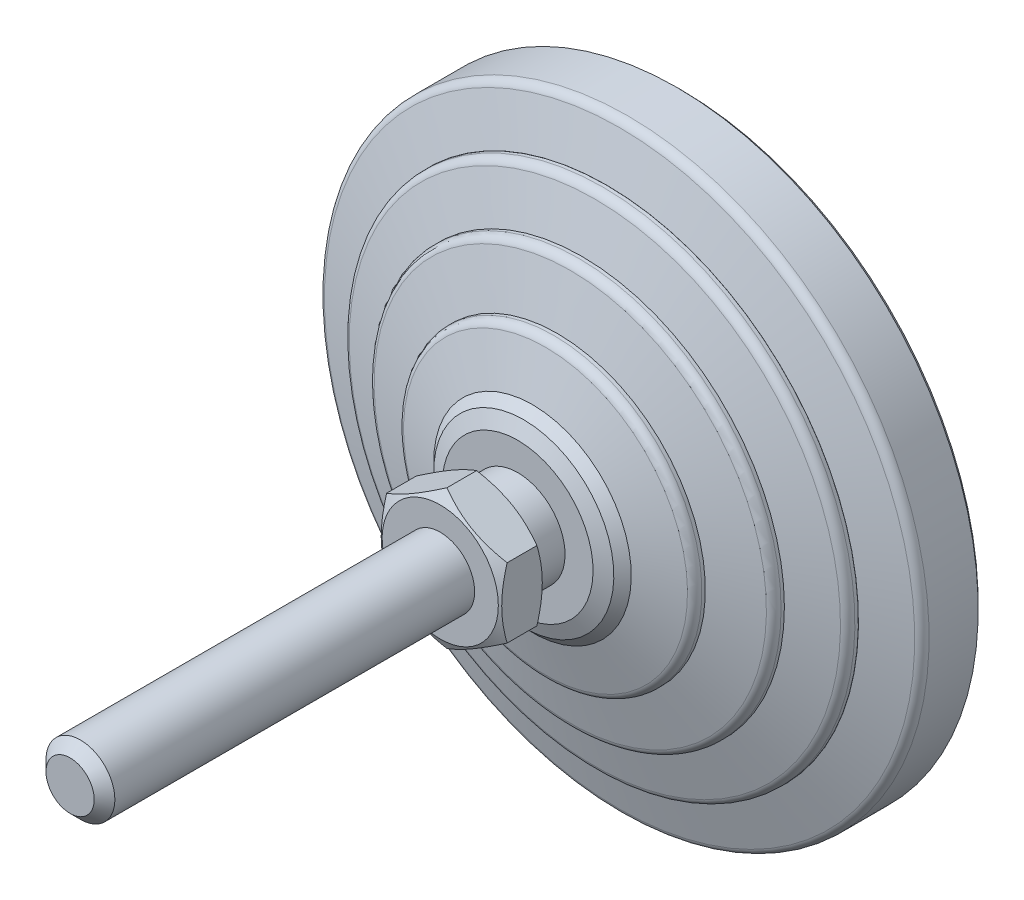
ISO-10303-21;
HEADER;
FILE_DESCRIPTION(('STEP AP214'),'2;1');
FILE_NAME('part.step','',(''),(''),'','','');
FILE_SCHEMA(('AUTOMOTIVE_DESIGN { 1 0 10303 214 1 1 1 1 }'));
ENDSEC;
DATA;
#1=APPLICATION_CONTEXT('core data for automotive mechanical design processes');
#2=APPLICATION_PROTOCOL_DEFINITION('international standard','automotive_design',2000,#1);
#3=PRODUCT_CONTEXT('',#1,'mechanical');
#4=PRODUCT('Part','Part','',(#3));
#5=PRODUCT_RELATED_PRODUCT_CATEGORY('part','',(#4));
#6=PRODUCT_DEFINITION_FORMATION('','',#4);
#7=PRODUCT_DEFINITION_CONTEXT('part definition',#1,'design');
#8=PRODUCT_DEFINITION('design','',#6,#7);
#9=PRODUCT_DEFINITION_SHAPE('','',#8);
#10=(LENGTH_UNIT() NAMED_UNIT(*) SI_UNIT(.MILLI.,.METRE.));
#11=(NAMED_UNIT(*) PLANE_ANGLE_UNIT() SI_UNIT($,.RADIAN.));
#12=(NAMED_UNIT(*) SI_UNIT($,.STERADIAN.) SOLID_ANGLE_UNIT());
#13=UNCERTAINTY_MEASURE_WITH_UNIT(LENGTH_MEASURE(1.E-05),#10,'distance_accuracy_value','');
#14=(GEOMETRIC_REPRESENTATION_CONTEXT(3) GLOBAL_UNCERTAINTY_ASSIGNED_CONTEXT((#13)) GLOBAL_UNIT_ASSIGNED_CONTEXT((#10,
#11,#12)) REPRESENTATION_CONTEXT('',''));
#15=CARTESIAN_POINT('',(0.,0.,0.));
#16=DIRECTION('',(0.,0.,1.));
#17=DIRECTION('',(1.,0.,0.));
#18=AXIS2_PLACEMENT_3D('',#15,#16,#17);
#19=CARTESIAN_POINT('',(-34.5,0.,0.));
#20=DIRECTION('',(0.,0.,1.));
#21=DIRECTION('',(0.,-1.,0.));
#22=AXIS2_PLACEMENT_3D('',#19,#20,#21);
#23=PLANE('',#22);
#24=CARTESIAN_POINT('',(0.,0.,0.));
#25=DIRECTION('',(0.,0.,-1.));
#26=DIRECTION('',(0.,1.,0.));
#27=AXIS2_PLACEMENT_3D('',#24,#25,#26);
#28=CIRCLE('',#27,34.5);
#29=CARTESIAN_POINT('',(0.,34.5,0.));
#30=VERTEX_POINT('',#29);
#31=EDGE_CURVE('E95',#30,#30,#28,.T.);
#32=ORIENTED_EDGE('',*,*,#31,.T.);
#33=EDGE_LOOP('',(#32));
#34=FACE_BOUND('',#33,.T.);
#35=ADVANCED_FACE('F14',(#34),#23,.F.);
#36=CARTESIAN_POINT('',(-5.49999999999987,0.,23.));
#37=DIRECTION('',(0.,0.,1.));
#38=DIRECTION('',(0.,-1.,0.));
#39=AXIS2_PLACEMENT_3D('',#36,#37,#38);
#40=PLANE('',#39);
#41=CARTESIAN_POINT('',(0.,0.,23.));
#42=DIRECTION('',(0.,0.,1.));
#43=DIRECTION('',(1.,0.,0.));
#44=AXIS2_PLACEMENT_3D('',#41,#42,#43);
#45=CIRCLE('',#44,6.75);
#46=CARTESIAN_POINT('',(6.75,0.,23.));
#47=VERTEX_POINT('',#46);
#48=EDGE_CURVE('E604',#47,#47,#45,.T.);
#49=ORIENTED_EDGE('',*,*,#48,.F.);
#50=EDGE_LOOP('',(#49));
#51=FACE_BOUND('',#50,.T.);
#52=CARTESIAN_POINT('',(0.,0.,23.));
#53=DIRECTION('',(0.,0.,-1.));
#54=DIRECTION('',(0.,1.,0.));
#55=AXIS2_PLACEMENT_3D('',#52,#53,#54);
#56=CIRCLE('',#55,5.49999999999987);
#57=CARTESIAN_POINT('',(0.,5.49999999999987,23.));
#58=VERTEX_POINT('',#57);
#59=EDGE_CURVE('E149',#58,#58,#56,.T.);
#60=ORIENTED_EDGE('',*,*,#59,.F.);
#61=EDGE_LOOP('',(#60));
#62=FACE_BOUND('',#61,.T.);
#63=ADVANCED_FACE('F175',(#51,#62),#40,.F.);
#64=CARTESIAN_POINT('',(0.,0.,0.));
#65=DIRECTION('',(0.,0.,-1.));
#66=DIRECTION('',(0.,1.,0.));
#67=AXIS2_PLACEMENT_3D('',#64,#65,#66);
#68=CYLINDRICAL_SURFACE('',#67,5.49999999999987);
#69=CARTESIAN_POINT('',(0.,0.,19.));
#70=DIRECTION('',(0.,0.,-1.));
#71=DIRECTION('',(0.,1.,0.));
#72=AXIS2_PLACEMENT_3D('',#69,#70,#71);
#73=CIRCLE('',#72,5.49999999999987);
#74=CARTESIAN_POINT('',(0.,5.49999999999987,19.));
#75=VERTEX_POINT('',#74);
#76=EDGE_CURVE('E146',#75,#75,#73,.T.);
#77=ORIENTED_EDGE('',*,*,#76,.F.);
#78=EDGE_LOOP('',(#77));
#79=FACE_BOUND('',#78,.T.);
#80=ORIENTED_EDGE('',*,*,#59,.T.);
#81=EDGE_LOOP('',(#80));
#82=FACE_BOUND('',#81,.T.);
#83=ADVANCED_FACE('F181',(#79,#82),#68,.T.);
#84=CARTESIAN_POINT('',(-8.7540983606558,0.,19.));
#85=DIRECTION('',(0.,0.,-1.));
#86=DIRECTION('',(0.,1.,0.));
#87=AXIS2_PLACEMENT_3D('',#84,#85,#86);
#88=PLANE('',#87);
#89=CARTESIAN_POINT('',(0.,0.,19.));
#90=DIRECTION('',(0.,0.,-1.));
#91=DIRECTION('',(0.,1.,0.));
#92=AXIS2_PLACEMENT_3D('',#89,#90,#91);
#93=CIRCLE('',#92,8.7540983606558);
#94=CARTESIAN_POINT('',(0.,8.7540983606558,19.));
#95=VERTEX_POINT('',#94);
#96=EDGE_CURVE('E143',#95,#95,#93,.T.);
#97=ORIENTED_EDGE('',*,*,#96,.F.);
#98=EDGE_LOOP('',(#97));
#99=FACE_BOUND('',#98,.T.);
#100=ORIENTED_EDGE('',*,*,#76,.T.);
#101=EDGE_LOOP('',(#100));
#102=FACE_BOUND('',#101,.T.);
#103=ADVANCED_FACE('F278',(#99,#102),#88,.F.);
#104=CARTESIAN_POINT('',(0.,0.,19.));
#105=DIRECTION('',(0.,0.,-1.));
#106=DIRECTION('',(0.,1.,0.));
#107=AXIS2_PLACEMENT_3D('',#104,#105,#106);
#108=CONICAL_SURFACE('',#107,8.7540983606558,1.17809724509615);
#109=CARTESIAN_POINT('',(0.,0.,18.2928932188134));
#110=DIRECTION('',(0.,0.,-1.));
#111=DIRECTION('',(0.,1.,0.));
#112=AXIS2_PLACEMENT_3D('',#109,#110,#111);
#113=CIRCLE('',#112,10.4612051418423);
#114=CARTESIAN_POINT('',(0.,10.4612051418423,18.2928932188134));
#115=VERTEX_POINT('',#114);
#116=EDGE_CURVE('E140',#115,#115,#113,.T.);
#117=ORIENTED_EDGE('',*,*,#116,.F.);
#118=EDGE_LOOP('',(#117));
#119=FACE_BOUND('',#118,.T.);
#120=ORIENTED_EDGE('',*,*,#96,.T.);
#121=EDGE_LOOP('',(#120));
#122=FACE_BOUND('',#121,.T.);
#123=ADVANCED_FACE('F272',(#119,#122),#108,.T.);
#124=CARTESIAN_POINT('',(0.,0.,18.2928932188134));
#125=DIRECTION('',(0.,0.,-1.));
#126=DIRECTION('',(0.,1.,0.));
#127=AXIS2_PLACEMENT_3D('',#124,#125,#126);
#128=CONICAL_SURFACE('',#127,10.4612051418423,0.785398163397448);
#129=CARTESIAN_POINT('',(0.,0.,17.2786885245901));
#130=DIRECTION('',(0.,0.,-1.));
#131=DIRECTION('',(0.,1.,0.));
#132=AXIS2_PLACEMENT_3D('',#129,#130,#131);
#133=CIRCLE('',#132,11.4754098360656);
#134=CARTESIAN_POINT('',(0.,11.4754098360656,17.2786885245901));
#135=VERTEX_POINT('',#134);
#136=EDGE_CURVE('E137',#135,#135,#133,.T.);
#137=ORIENTED_EDGE('',*,*,#136,.F.);
#138=EDGE_LOOP('',(#137));
#139=FACE_BOUND('',#138,.T.);
#140=ORIENTED_EDGE('',*,*,#116,.T.);
#141=EDGE_LOOP('',(#140));
#142=FACE_BOUND('',#141,.T.);
#143=ADVANCED_FACE('F266',(#139,#142),#128,.T.);
#144=CARTESIAN_POINT('',(0.,0.,17.2786885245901));
#145=DIRECTION('',(0.,0.,-1.));
#146=DIRECTION('',(0.,1.,0.));
#147=AXIS2_PLACEMENT_3D('',#144,#145,#146);
#148=CONICAL_SURFACE('',#147,11.4754098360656,1.27933953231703);
#149=CARTESIAN_POINT('',(0.,0.,15.7711726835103));
#150=DIRECTION('',(0.,0.,-1.));
#151=DIRECTION('',(0.,1.,0.));
#152=AXIS2_PLACEMENT_3D('',#149,#150,#151);
#153=CIRCLE('',#152,16.5004626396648);
#154=CARTESIAN_POINT('',(0.,16.5004626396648,15.7711726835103));
#155=VERTEX_POINT('',#154);
#156=EDGE_CURVE('E134',#155,#155,#153,.T.);
#157=ORIENTED_EDGE('',*,*,#156,.F.);
#158=EDGE_LOOP('',(#157));
#159=FACE_BOUND('',#158,.T.);
#160=ORIENTED_EDGE('',*,*,#136,.T.);
#161=EDGE_LOOP('',(#160));
#162=FACE_BOUND('',#161,.T.);
#163=ADVANCED_FACE('F260',(#159,#162),#148,.T.);
#164=CARTESIAN_POINT('',(0.,0.,14.8133463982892));
#165=DIRECTION('',(0.,0.,-1.));
#166=DIRECTION('',(0.,1.,0.));
#167=AXIS2_PLACEMENT_3D('',#164,#165,#166);
#168=TOROIDAL_SURFACE('',#167,16.2131147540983,1.);
#169=CARTESIAN_POINT('',(0.,0.,14.8133463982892));
#170=DIRECTION('',(0.,0.,-1.));
#171=DIRECTION('',(0.,1.,0.));
#172=AXIS2_PLACEMENT_3D('',#169,#170,#171);
#173=CIRCLE('',#172,17.2131147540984);
#174=CARTESIAN_POINT('',(0.,17.2131147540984,14.8133463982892));
#175=VERTEX_POINT('',#174);
#176=EDGE_CURVE('E131',#175,#175,#173,.T.);
#177=ORIENTED_EDGE('',*,*,#176,.F.);
#178=EDGE_LOOP('',(#177));
#179=FACE_BOUND('',#178,.T.);
#180=ORIENTED_EDGE('',*,*,#156,.T.);
#181=EDGE_LOOP('',(#180));
#182=FACE_BOUND('',#181,.T.);
#183=ADVANCED_FACE('F254',(#179,#182),#168,.T.);
#184=CARTESIAN_POINT('',(0.,0.,0.));
#185=DIRECTION('',(0.,0.,-1.));
#186=DIRECTION('',(0.,1.,0.));
#187=AXIS2_PLACEMENT_3D('',#184,#185,#186);
#188=CYLINDRICAL_SURFACE('',#187,17.2131147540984);
#189=CARTESIAN_POINT('',(0.,0.,14.4098360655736));
#190=DIRECTION('',(0.,0.,-1.));
#191=DIRECTION('',(0.,1.,0.));
#192=AXIS2_PLACEMENT_3D('',#189,#190,#191);
#193=CIRCLE('',#192,17.2131147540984);
#194=CARTESIAN_POINT('',(0.,17.2131147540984,14.4098360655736));
#195=VERTEX_POINT('',#194);
#196=EDGE_CURVE('E128',#195,#195,#193,.T.);
#197=ORIENTED_EDGE('',*,*,#196,.F.);
#198=EDGE_LOOP('',(#197));
#199=FACE_BOUND('',#198,.T.);
#200=ORIENTED_EDGE('',*,*,#176,.T.);
#201=EDGE_LOOP('',(#200));
#202=FACE_BOUND('',#201,.T.);
#203=ADVANCED_FACE('F248',(#199,#202),#188,.T.);
#204=CARTESIAN_POINT('',(0.,0.,14.4098360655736));
#205=DIRECTION('',(0.,0.,-1.));
#206=DIRECTION('',(0.,1.,0.));
#207=AXIS2_PLACEMENT_3D('',#204,#205,#206);
#208=CONICAL_SURFACE('',#207,17.2131147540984,1.30454427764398);
#209=CARTESIAN_POINT('',(0.,0.,12.8894925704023));
#210=DIRECTION('',(0.,0.,-1.));
#211=DIRECTION('',(0.,1.,0.));
#212=AXIS2_PLACEMENT_3D('',#209,#210,#211);
#213=CIRCLE('',#212,22.7877075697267);
#214=CARTESIAN_POINT('',(0.,22.7877075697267,12.8894925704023));
#215=VERTEX_POINT('',#214);
#216=EDGE_CURVE('E125',#215,#215,#213,.T.);
#217=ORIENTED_EDGE('',*,*,#216,.F.);
#218=EDGE_LOOP('',(#217));
#219=FACE_BOUND('',#218,.T.);
#220=ORIENTED_EDGE('',*,*,#196,.T.);
#221=EDGE_LOOP('',(#220));
#222=FACE_BOUND('',#221,.T.);
#223=ADVANCED_FACE('F242',(#219,#222),#208,.T.);
#224=CARTESIAN_POINT('',(0.,0.,11.9247287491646));
#225=DIRECTION('',(0.,0.,-1.));
#226=DIRECTION('',(0.,1.,0.));
#227=AXIS2_PLACEMENT_3D('',#224,#225,#226);
#228=TOROIDAL_SURFACE('',#227,22.5245901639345,1.);
#229=CARTESIAN_POINT('',(0.,0.,11.9247287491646));
#230=DIRECTION('',(0.,0.,-1.));
#231=DIRECTION('',(0.,1.,0.));
#232=AXIS2_PLACEMENT_3D('',#229,#230,#231);
#233=CIRCLE('',#232,23.5245901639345);
#234=CARTESIAN_POINT('',(0.,23.5245901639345,11.9247287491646));
#235=VERTEX_POINT('',#234);
#236=EDGE_CURVE('E122',#235,#235,#233,.T.);
#237=ORIENTED_EDGE('',*,*,#236,.F.);
#238=EDGE_LOOP('',(#237));
#239=FACE_BOUND('',#238,.T.);
#240=ORIENTED_EDGE('',*,*,#216,.T.);
#241=EDGE_LOOP('',(#240));
#242=FACE_BOUND('',#241,.T.);
#243=ADVANCED_FACE('F236',(#239,#242),#228,.T.);
#244=CARTESIAN_POINT('',(0.,0.,0.));
#245=DIRECTION('',(0.,0.,-1.));
#246=DIRECTION('',(0.,1.,0.));
#247=AXIS2_PLACEMENT_3D('',#244,#245,#246);
#248=CYLINDRICAL_SURFACE('',#247,23.5245901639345);
#249=CARTESIAN_POINT('',(0.,0.,11.5409836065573));
#250=DIRECTION('',(0.,0.,-1.));
#251=DIRECTION('',(0.,1.,0.));
#252=AXIS2_PLACEMENT_3D('',#249,#250,#251);
#253=CIRCLE('',#252,23.5245901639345);
#254=CARTESIAN_POINT('',(0.,23.5245901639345,11.5409836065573));
#255=VERTEX_POINT('',#254);
#256=EDGE_CURVE('E119',#255,#255,#253,.T.);
#257=ORIENTED_EDGE('',*,*,#256,.F.);
#258=EDGE_LOOP('',(#257));
#259=FACE_BOUND('',#258,.T.);
#260=ORIENTED_EDGE('',*,*,#236,.T.);
#261=EDGE_LOOP('',(#260));
#262=FACE_BOUND('',#261,.T.);
#263=ADVANCED_FACE('F230',(#259,#262),#248,.T.);
#264=CARTESIAN_POINT('',(0.,0.,11.5409836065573));
#265=DIRECTION('',(0.,0.,-1.));
#266=DIRECTION('',(0.,1.,0.));
#267=AXIS2_PLACEMENT_3D('',#264,#265,#266);
#268=CONICAL_SURFACE('',#267,23.5245901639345,1.27871257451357);
#269=CARTESIAN_POINT('',(0.,0.,10.0337743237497));
#270=DIRECTION('',(0.,0.,-1.));
#271=DIRECTION('',(0.,1.,0.));
#272=AXIS2_PLACEMENT_3D('',#269,#270,#271);
#273=CIRCLE('',#272,28.5372004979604);
#274=CARTESIAN_POINT('',(0.,28.5372004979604,10.0337743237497));
#275=VERTEX_POINT('',#274);
#276=EDGE_CURVE('E116',#275,#275,#273,.T.);
#277=ORIENTED_EDGE('',*,*,#276,.F.);
#278=EDGE_LOOP('',(#277));
#279=FACE_BOUND('',#278,.T.);
#280=ORIENTED_EDGE('',*,*,#256,.T.);
#281=EDGE_LOOP('',(#280));
#282=FACE_BOUND('',#281,.T.);
#283=ADVANCED_FACE('F224',(#279,#282),#268,.T.);
#284=CARTESIAN_POINT('',(0.,0.,9.07612838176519));
#285=DIRECTION('',(0.,0.,-1.));
#286=DIRECTION('',(0.,1.,0.));
#287=AXIS2_PLACEMENT_3D('',#284,#285,#286);
#288=TOROIDAL_SURFACE('',#287,28.2492521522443,1.);
#289=CARTESIAN_POINT('',(0.,0.,9.07612838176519));
#290=DIRECTION('',(0.,0.,-1.));
#291=DIRECTION('',(0.,1.,0.));
#292=AXIS2_PLACEMENT_3D('',#289,#290,#291);
#293=CIRCLE('',#292,29.2492521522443);
#294=CARTESIAN_POINT('',(0.,29.2492521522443,9.07612838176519));
#295=VERTEX_POINT('',#294);
#296=EDGE_CURVE('E113',#295,#295,#293,.T.);
#297=ORIENTED_EDGE('',*,*,#296,.F.);
#298=EDGE_LOOP('',(#297));
#299=FACE_BOUND('',#298,.T.);
#300=ORIENTED_EDGE('',*,*,#276,.T.);
#301=EDGE_LOOP('',(#300));
#302=FACE_BOUND('',#301,.T.);
#303=ADVANCED_FACE('F218',(#299,#302),#288,.T.);
#304=CARTESIAN_POINT('',(0.,0.,0.));
#305=DIRECTION('',(0.,0.,-1.));
#306=DIRECTION('',(0.,1.,0.));
#307=AXIS2_PLACEMENT_3D('',#304,#305,#306);
#308=CYLINDRICAL_SURFACE('',#307,29.2492521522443);
#309=CARTESIAN_POINT('',(0.,0.,8.67213114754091));
#310=DIRECTION('',(0.,0.,-1.));
#311=DIRECTION('',(0.,1.,0.));
#312=AXIS2_PLACEMENT_3D('',#309,#310,#311);
#313=CIRCLE('',#312,29.2492521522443);
#314=CARTESIAN_POINT('',(0.,29.2492521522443,8.67213114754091));
#315=VERTEX_POINT('',#314);
#316=EDGE_CURVE('E110',#315,#315,#313,.T.);
#317=ORIENTED_EDGE('',*,*,#316,.F.);
#318=EDGE_LOOP('',(#317));
#319=FACE_BOUND('',#318,.T.);
#320=ORIENTED_EDGE('',*,*,#296,.T.);
#321=EDGE_LOOP('',(#320));
#322=FACE_BOUND('',#321,.T.);
#323=ADVANCED_FACE('F212',(#319,#322),#308,.T.);
#324=CARTESIAN_POINT('',(-29.2622950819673,0.,8.67213114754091));
#325=DIRECTION('',(0.,0.,-1.));
#326=DIRECTION('',(0.,1.,0.));
#327=AXIS2_PLACEMENT_3D('',#324,#325,#326);
#328=PLANE('',#327);
#329=CARTESIAN_POINT('',(0.,0.,8.67213114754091));
#330=DIRECTION('',(0.,0.,-1.));
#331=DIRECTION('',(0.,1.,0.));
#332=AXIS2_PLACEMENT_3D('',#329,#330,#331);
#333=CIRCLE('',#332,29.2622950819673);
#334=CARTESIAN_POINT('',(0.,29.2622950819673,8.67213114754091));
#335=VERTEX_POINT('',#334);
#336=EDGE_CURVE('E107',#335,#335,#333,.T.);
#337=ORIENTED_EDGE('',*,*,#336,.F.);
#338=EDGE_LOOP('',(#337));
#339=FACE_BOUND('',#338,.T.);
#340=ORIENTED_EDGE('',*,*,#316,.T.);
#341=EDGE_LOOP('',(#340));
#342=FACE_BOUND('',#341,.T.);
#343=ADVANCED_FACE('F206',(#339,#342),#328,.F.);
#344=CARTESIAN_POINT('',(0.,0.,8.67213114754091));
#345=DIRECTION('',(0.,0.,-1.));
#346=DIRECTION('',(0.,1.,0.));
#347=AXIS2_PLACEMENT_3D('',#344,#345,#346);
#348=CONICAL_SURFACE('',#347,29.2622950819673,1.27933953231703);
#349=CARTESIAN_POINT('',(0.,0.,7.16461530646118));
#350=DIRECTION('',(0.,0.,-1.));
#351=DIRECTION('',(0.,1.,0.));
#352=AXIS2_PLACEMENT_3D('',#349,#350,#351);
#353=CIRCLE('',#352,34.2873478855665);
#354=CARTESIAN_POINT('',(0.,34.2873478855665,7.16461530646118));
#355=VERTEX_POINT('',#354);
#356=EDGE_CURVE('E104',#355,#355,#353,.T.);
#357=ORIENTED_EDGE('',*,*,#356,.F.);
#358=EDGE_LOOP('',(#357));
#359=FACE_BOUND('',#358,.T.);
#360=ORIENTED_EDGE('',*,*,#336,.T.);
#361=EDGE_LOOP('',(#360));
#362=FACE_BOUND('',#361,.T.);
#363=ADVANCED_FACE('F200',(#359,#362),#348,.T.);
#364=CARTESIAN_POINT('',(0.,0.,6.20678902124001));
#365=DIRECTION('',(0.,0.,-1.));
#366=DIRECTION('',(0.,1.,0.));
#367=AXIS2_PLACEMENT_3D('',#364,#365,#366);
#368=TOROIDAL_SURFACE('',#367,34.,1.);
#369=CARTESIAN_POINT('',(0.,0.,6.20678902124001));
#370=DIRECTION('',(0.,0.,-1.));
#371=DIRECTION('',(0.,1.,0.));
#372=AXIS2_PLACEMENT_3D('',#369,#370,#371);
#373=CIRCLE('',#372,35.);
#374=CARTESIAN_POINT('',(0.,35.,6.20678902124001));
#375=VERTEX_POINT('',#374);
#376=EDGE_CURVE('E101',#375,#375,#373,.T.);
#377=ORIENTED_EDGE('',*,*,#376,.F.);
#378=EDGE_LOOP('',(#377));
#379=FACE_BOUND('',#378,.T.);
#380=ORIENTED_EDGE('',*,*,#356,.T.);
#381=EDGE_LOOP('',(#380));
#382=FACE_BOUND('',#381,.T.);
#383=ADVANCED_FACE('F194',(#379,#382),#368,.T.);
#384=CARTESIAN_POINT('',(0.,0.,0.));
#385=DIRECTION('',(0.,0.,-1.));
#386=DIRECTION('',(0.,1.,0.));
#387=AXIS2_PLACEMENT_3D('',#384,#385,#386);
#388=CYLINDRICAL_SURFACE('',#387,35.);
#389=CARTESIAN_POINT('',(0.,0.,0.5));
#390=DIRECTION('',(0.,0.,-1.));
#391=DIRECTION('',(0.,1.,0.));
#392=AXIS2_PLACEMENT_3D('',#389,#390,#391);
#393=CIRCLE('',#392,35.);
#394=CARTESIAN_POINT('',(0.,35.,0.5));
#395=VERTEX_POINT('',#394);
#396=EDGE_CURVE('E98',#395,#395,#393,.T.);
#397=ORIENTED_EDGE('',*,*,#396,.F.);
#398=EDGE_LOOP('',(#397));
#399=FACE_BOUND('',#398,.T.);
#400=ORIENTED_EDGE('',*,*,#376,.T.);
#401=EDGE_LOOP('',(#400));
#402=FACE_BOUND('',#401,.T.);
#403=ADVANCED_FACE('F188',(#399,#402),#388,.T.);
#404=CARTESIAN_POINT('',(0.,0.,0.5));
#405=DIRECTION('',(0.,0.,1.));
#406=DIRECTION('',(0.,-1.,0.));
#407=AXIS2_PLACEMENT_3D('',#404,#405,#406);
#408=CONICAL_SURFACE('',#407,35.,0.785398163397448);
#409=ORIENTED_EDGE('',*,*,#31,.F.);
#410=EDGE_LOOP('',(#409));
#411=FACE_BOUND('',#410,.T.);
#412=ORIENTED_EDGE('',*,*,#396,.T.);
#413=EDGE_LOOP('',(#412));
#414=FACE_BOUND('',#413,.T.);
#415=ADVANCED_FACE('F173',(#411,#414),#408,.T.);
#416=CARTESIAN_POINT('',(0.,0.,23.));
#417=DIRECTION('',(0.,0.,1.));
#418=DIRECTION('',(1.,0.,0.));
#419=AXIS2_PLACEMENT_3D('',#416,#417,#418);
#420=CONICAL_SURFACE('',#419,6.75,1.0471975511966);
#421=CARTESIAN_POINT('',(0.000200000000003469,-8.08301923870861,23.7696190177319));
#422=CARTESIAN_POINT('',(-0.153667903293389,-7.99418356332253,23.7183374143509));
#423=CARTESIAN_POINT('',(-0.308109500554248,-7.90501666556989,23.669383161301));
#424=CARTESIAN_POINT('',(-0.618246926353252,-7.72595873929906,23.5767703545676));
#425=CARTESIAN_POINT('',(-0.773943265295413,-7.63606741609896,23.5331140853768));
#426=CARTESIAN_POINT('',(-1.24352516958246,-7.36495417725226,23.4109491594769));
#427=CARTESIAN_POINT('',(-1.5592643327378,-7.18266208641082,23.3414631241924));
#428=CARTESIAN_POINT('',(-2.03176224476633,-6.90986528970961,23.2599825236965));
#429=CARTESIAN_POINT('',(-2.18710922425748,-6.8201756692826,23.2367710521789));
#430=CARTESIAN_POINT('',(-2.49850511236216,-6.64039116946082,23.1978487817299));
#431=CARTESIAN_POINT('',(-2.65455395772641,-6.55029632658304,23.1821373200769));
#432=CARTESIAN_POINT('',(-2.96692267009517,-6.36995016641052,23.1586154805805));
#433=CARTESIAN_POINT('',(-3.12324202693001,-6.27969914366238,23.1507961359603));
#434=CARTESIAN_POINT('',(-3.43601650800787,-6.09911871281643,23.1432178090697));
#435=CARTESIAN_POINT('',(-3.59247162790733,-6.00878930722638,23.1434585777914));
#436=CARTESIAN_POINT('',(-4.02110687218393,-5.76131663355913,23.155197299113));
#437=CARTESIAN_POINT('',(-4.2931466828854,-5.60425437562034,23.1749033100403));
#438=CARTESIAN_POINT('',(-4.83541944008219,-5.29117305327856,23.2373910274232));
#439=CARTESIAN_POINT('',(-5.10565047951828,-5.13515508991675,23.2801940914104));
#440=CARTESIAN_POINT('',(-5.64901454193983,-4.8214437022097,23.3871892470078));
#441=CARTESIAN_POINT('',(-5.92207900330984,-4.6637898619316,23.4518346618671));
#442=CARTESIAN_POINT('',(-6.46413578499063,-4.35083323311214,23.5985536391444));
#443=CARTESIAN_POINT('',(-6.73313504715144,-4.19552643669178,23.680592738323));
#444=CARTESIAN_POINT('',(-7.0002,-4.04133641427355,23.7696190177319));
#445=B_SPLINE_CURVE_WITH_KNOTS('',3,(#421,#422,#423,#424,#425,#426,#427,#428,#429,#430,#431,
#432,#433,#434,#435,#436,#437,#438,#439,#440,#441,#442,#443,#444),.UNSPECIFIED.,.F.,.F.,(4,2,2,
2,2,2,2,2,2,2,2,4),(0.,0.554727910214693,1.10969417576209,2.2219327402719,2.76443041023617,
3.30688013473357,3.8487128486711,4.39052882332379,5.33376515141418,6.27787517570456,
7.2429241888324,8.20607866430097),.UNSPECIFIED.);
#446=CARTESIAN_POINT('',(0.,-8.08290376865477,23.7695523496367));
#447=VERTEX_POINT('',#446);
#448=CARTESIAN_POINT('',(-7.,-4.04145188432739,23.7695523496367));
#449=VERTEX_POINT('',#448);
#450=EDGE_CURVE('E72',#447,#449,#445,.T.);
#451=ORIENTED_EDGE('',*,*,#450,.T.);
#452=CARTESIAN_POINT('',(-7.,-10.8487843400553,26.5571042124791));
#453=CARTESIAN_POINT('',(-7.,-10.5431066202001,26.4088514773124));
#454=CARTESIAN_POINT('',(-7.,-10.2367264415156,26.2620222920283));
#455=CARTESIAN_POINT('',(-7.,-9.62218756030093,25.9720117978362));
#456=CARTESIAN_POINT('',(-7.,-9.31402858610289,25.8288310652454));
#457=CARTESIAN_POINT('',(-7.,-8.69396741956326,25.5461964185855));
#458=CARTESIAN_POINT('',(-7.,-8.38205397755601,25.4067670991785));
#459=CARTESIAN_POINT('',(-7.,-7.75574381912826,25.1336238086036));
#460=CARTESIAN_POINT('',(-7.,-7.4413472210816,24.999909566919));
#461=CARTESIAN_POINT('',(-7.,-6.79945094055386,24.7355377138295));
#462=CARTESIAN_POINT('',(-7.,-6.47185398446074,24.605114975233));
#463=CARTESIAN_POINT('',(-7.,-5.81282560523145,24.3541574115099));
#464=CARTESIAN_POINT('',(-7.,-5.48139375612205,24.2336236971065));
#465=CARTESIAN_POINT('',(-7.,-4.81478690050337,24.0056139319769));
#466=CARTESIAN_POINT('',(-7.,-4.47962105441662,23.8981113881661));
#467=CARTESIAN_POINT('',(-7.,-3.80449366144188,23.6996167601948));
#468=CARTESIAN_POINT('',(-7.,-3.46453366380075,23.6086194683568));
#469=CARTESIAN_POINT('',(-7.,-2.78145333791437,23.4479964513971));
#470=CARTESIAN_POINT('',(-7.,-2.43836094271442,23.3782551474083));
#471=CARTESIAN_POINT('',(-7.,-1.920603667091,23.2926081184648));
#472=CARTESIAN_POINT('',(-7.,-1.7474853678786,23.2672187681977));
#473=CARTESIAN_POINT('',(-7.,-1.40039067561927,23.2232598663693));
#474=CARTESIAN_POINT('',(-7.,-1.22641436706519,23.2046896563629));
#475=CARTESIAN_POINT('',(-7.,-0.88010655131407,23.1749715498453));
#476=CARTESIAN_POINT('',(-7.,-0.707783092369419,23.1637302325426));
#477=CARTESIAN_POINT('',(-7.,-0.362815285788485,23.148544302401));
#478=CARTESIAN_POINT('',(-7.,-0.190170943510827,23.1445995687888));
#479=CARTESIAN_POINT('',(-7.,0.155130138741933,23.1441008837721));
#480=CARTESIAN_POINT('',(-7.,0.327786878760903,23.1475469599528));
#481=CARTESIAN_POINT('',(-7.,0.672801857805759,23.1617458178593));
#482=CARTESIAN_POINT('',(-7.,0.845160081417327,23.1724989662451));
#483=CARTESIAN_POINT('',(-7.,1.25960036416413,23.206913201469));
#484=CARTESIAN_POINT('',(-7.,1.50139962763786,23.2340529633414));
#485=CARTESIAN_POINT('',(-7.,1.98318754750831,23.3012311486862));
#486=CARTESIAN_POINT('',(-7.,2.22317595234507,23.3412713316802));
#487=CARTESIAN_POINT('',(-7.,2.94015935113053,23.4786180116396));
#488=CARTESIAN_POINT('',(-7.,3.41390204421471,23.5931252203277));
#489=CARTESIAN_POINT('',(-7.,4.12226739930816,23.7914942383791));
#490=CARTESIAN_POINT('',(-7.,4.36056920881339,23.8629719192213));
#491=CARTESIAN_POINT('',(-7.,4.83485791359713,24.0133023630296));
#492=CARTESIAN_POINT('',(-7.,5.07084479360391,24.0921551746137));
#493=CARTESIAN_POINT('',(-7.,5.54057883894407,24.2559747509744));
#494=CARTESIAN_POINT('',(-7.,5.77432672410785,24.3409394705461));
#495=CARTESIAN_POINT('',(-7.,6.23988905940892,24.5159880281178));
#496=CARTESIAN_POINT('',(-7.,6.47170353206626,24.6060718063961));
#497=CARTESIAN_POINT('',(-7.,7.01829239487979,24.8243184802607));
#498=CARTESIAN_POINT('',(-7.,7.33232549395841,24.954334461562));
#499=CARTESIAN_POINT('',(-7.,7.95772686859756,25.2206432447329));
#500=CARTESIAN_POINT('',(-7.,8.26909498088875,25.3569364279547));
#501=CARTESIAN_POINT('',(-7.,8.88965619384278,25.6345397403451));
#502=CARTESIAN_POINT('',(-7.,9.19884884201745,25.7758508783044));
#503=CARTESIAN_POINT('',(-7.,9.81537155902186,26.0624866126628));
#504=CARTESIAN_POINT('',(-7.,10.122701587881,26.2078112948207));
#505=CARTESIAN_POINT('',(-7.,10.7361251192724,26.501875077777));
#506=CARTESIAN_POINT('',(-7.,11.042216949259,26.6506176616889));
#507=CARTESIAN_POINT('',(-7.,11.6530826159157,26.9507875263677));
#508=CARTESIAN_POINT('',(-7.,11.957856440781,27.1022148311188));
#509=CARTESIAN_POINT('',(-7.,12.8704346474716,27.5597697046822));
#510=CARTESIAN_POINT('',(-7.,13.4765779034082,27.8692099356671));
#511=CARTESIAN_POINT('',(-7.,14.634965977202,28.4681022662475));
#512=CARTESIAN_POINT('',(-7.,15.1874698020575,28.7570556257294));
#513=CARTESIAN_POINT('',(-7.,16.2904254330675,29.3388966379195));
#514=CARTESIAN_POINT('',(-7.,16.8408771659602,29.6317844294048));
#515=CARTESIAN_POINT('',(-7.,17.9388108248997,30.2198233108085));
#516=CARTESIAN_POINT('',(-7.,18.4862967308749,30.5149669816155));
#517=CARTESIAN_POINT('',(-7.,19.5799564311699,31.1076048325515));
#518=CARTESIAN_POINT('',(-7.,20.1261302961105,31.405098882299));
#519=CARTESIAN_POINT('',(-7.,20.6718212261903,31.7034702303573));
#520=B_SPLINE_CURVE_WITH_KNOTS('',3,(#452,#453,#454,#455,#456,#457,#458,#459,#460,#461,#462,
#463,#464,#465,#466,#467,#468,#469,#470,#471,#472,#473,#474,#475,#476,#477,#478,#479,#480,#481,
#482,#483,#484,#485,#486,#487,#488,#489,#490,#491,#492,#493,#494,#495,#496,#497,#498,#499,#500,
#501,#502,#503,#504,#505,#506,#507,#508,#509,#510,#511,#512,#513,#514,#515,#516,#517,#518,#519),
.UNSPECIFIED.,.F.,.F.,(4,2,2,2,2,2,2,2,2,2,2,2,2,2,2,2,2,2,2,2,2,2,2,2,2,2,2,2,2,2,2,2,2,4),(0.,
1.01920807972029,2.03857616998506,3.06350572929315,4.08838672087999,5.14607601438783,
6.2038839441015,7.25950387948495,8.31479016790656,9.36423155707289,9.88902892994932,
10.4137756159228,10.9316953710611,11.4496065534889,11.9675196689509,12.4854587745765,
13.2149991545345,13.9446390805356,15.4047303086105,16.1510406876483,16.8973559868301,
17.6434227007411,18.3894807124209,19.4090398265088,20.4286609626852,21.4484882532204,
22.4683373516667,23.4892763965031,24.5102245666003,26.5518472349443,28.4223358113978,
30.2928905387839,32.1588038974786,34.024614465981),.UNSPECIFIED.);
#521=CARTESIAN_POINT('',(-7.,4.04145188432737,23.7695523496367));
#522=VERTEX_POINT('',#521);
#523=EDGE_CURVE('E80',#449,#522,#520,.T.);
#524=ORIENTED_EDGE('',*,*,#523,.T.);
#525=CARTESIAN_POINT('',(-7.0002,4.04133641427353,23.7696190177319));
#526=CARTESIAN_POINT('',(-6.84633209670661,4.13017208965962,23.7183374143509));
#527=CARTESIAN_POINT('',(-6.69189049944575,4.21933898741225,23.669383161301));
#528=CARTESIAN_POINT('',(-6.38175307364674,4.39839691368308,23.5767703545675));
#529=CARTESIAN_POINT('',(-6.22605673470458,4.48828823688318,23.5331140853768));
#530=CARTESIAN_POINT('',(-5.75647483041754,4.75940147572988,23.4109491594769));
#531=CARTESIAN_POINT('',(-5.4407356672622,4.94169356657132,23.3414631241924));
#532=CARTESIAN_POINT('',(-4.96823775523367,5.21449036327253,23.2599825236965));
#533=CARTESIAN_POINT('',(-4.81289077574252,5.30417998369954,23.2367710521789));
#534=CARTESIAN_POINT('',(-4.50149488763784,5.48396448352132,23.1978487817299));
#535=CARTESIAN_POINT('',(-4.3454460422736,5.5740593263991,23.1821373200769));
#536=CARTESIAN_POINT('',(-4.03307732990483,5.75440548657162,23.1586154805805));
#537=CARTESIAN_POINT('',(-3.87675797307,5.84465650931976,23.1507961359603));
#538=CARTESIAN_POINT('',(-3.56398349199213,6.02523694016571,23.1432178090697));
#539=CARTESIAN_POINT('',(-3.40752837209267,6.11556634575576,23.1434585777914));
#540=CARTESIAN_POINT('',(-2.97889312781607,6.36303901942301,23.155197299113));
#541=CARTESIAN_POINT('',(-2.70685331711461,6.5201012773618,23.1749033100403));
#542=CARTESIAN_POINT('',(-2.16458055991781,6.83318259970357,23.2373910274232));
#543=CARTESIAN_POINT('',(-1.89434952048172,6.98920056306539,23.2801940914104));
#544=CARTESIAN_POINT('',(-1.35098545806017,7.30291195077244,23.3871892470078));
#545=CARTESIAN_POINT('',(-1.07792099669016,7.46056579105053,23.4518346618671));
#546=CARTESIAN_POINT('',(-0.535864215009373,7.77352241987,23.5985536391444));
#547=CARTESIAN_POINT('',(-0.266864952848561,7.92882921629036,23.680592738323));
#548=CARTESIAN_POINT('',(0.000199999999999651,8.08301923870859,23.7696190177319));
#549=B_SPLINE_CURVE_WITH_KNOTS('',3,(#525,#526,#527,#528,#529,#530,#531,#532,#533,#534,#535,
#536,#537,#538,#539,#540,#541,#542,#543,#544,#545,#546,#547,#548),.UNSPECIFIED.,.F.,.F.,(4,2,2,
2,2,2,2,2,2,2,2,4),(0.,0.554727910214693,1.10969417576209,2.22193274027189,2.76443041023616,
3.30688013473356,3.84871284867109,4.39052882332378,5.33376515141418,6.27787517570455,
7.24292418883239,8.20607866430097),.UNSPECIFIED.);
#550=CARTESIAN_POINT('',(0.,8.08290376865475,23.7695523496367));
#551=VERTEX_POINT('',#550);
#552=EDGE_CURVE('E559',#522,#551,#549,.T.);
#553=ORIENTED_EDGE('',*,*,#552,.T.);
#554=CARTESIAN_POINT('',(-0.000200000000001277,8.08301923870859,23.7696190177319));
#555=CARTESIAN_POINT('',(0.15366790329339,7.99418356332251,23.7183374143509));
#556=CARTESIAN_POINT('',(0.308109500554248,7.90501666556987,23.669383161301));
#557=CARTESIAN_POINT('',(0.618246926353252,7.72595873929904,23.5767703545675));
#558=CARTESIAN_POINT('',(0.773943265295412,7.63606741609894,23.5331140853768));
#559=CARTESIAN_POINT('',(1.24352516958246,7.36495417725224,23.4109491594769));
#560=CARTESIAN_POINT('',(1.5592643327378,7.1826620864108,23.3414631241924));
#561=CARTESIAN_POINT('',(2.03176224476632,6.90986528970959,23.2599825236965));
#562=CARTESIAN_POINT('',(2.18710922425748,6.82017566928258,23.2367710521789));
#563=CARTESIAN_POINT('',(2.49850511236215,6.6403911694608,23.1978487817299));
#564=CARTESIAN_POINT('',(2.6545539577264,6.55029632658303,23.1821373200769));
#565=CARTESIAN_POINT('',(2.96692267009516,6.3699501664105,23.1586154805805));
#566=CARTESIAN_POINT('',(3.12324202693,6.27969914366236,23.1507961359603));
#567=CARTESIAN_POINT('',(3.43601650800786,6.09911871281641,23.1432178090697));
#568=CARTESIAN_POINT('',(3.59247162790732,6.00878930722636,23.1434585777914));
#569=CARTESIAN_POINT('',(4.02110687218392,5.7613166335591,23.155197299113));
#570=CARTESIAN_POINT('',(4.29314668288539,5.60425437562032,23.1749033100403));
#571=CARTESIAN_POINT('',(4.83541944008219,5.29117305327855,23.2373910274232));
#572=CARTESIAN_POINT('',(5.10565047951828,5.13515508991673,23.2801940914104));
#573=CARTESIAN_POINT('',(5.64901454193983,4.82144370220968,23.3871892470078));
#574=CARTESIAN_POINT('',(5.92207900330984,4.66378986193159,23.4518346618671));
#575=CARTESIAN_POINT('',(6.46413578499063,4.35083323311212,23.5985536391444));
#576=CARTESIAN_POINT('',(6.73313504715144,4.19552643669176,23.680592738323));
#577=CARTESIAN_POINT('',(7.0002,4.04133641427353,23.7696190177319));
#578=B_SPLINE_CURVE_WITH_KNOTS('',3,(#554,#555,#556,#557,#558,#559,#560,#561,#562,#563,#564,
#565,#566,#567,#568,#569,#570,#571,#572,#573,#574,#575,#576,#577),.UNSPECIFIED.,.F.,.F.,(4,2,2,
2,2,2,2,2,2,2,2,4),(0.,0.554727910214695,1.10969417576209,2.22193274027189,2.76443041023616,
3.30688013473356,3.84871284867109,4.39052882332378,5.33376515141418,6.27787517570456,
7.2429241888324,8.20607866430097),.UNSPECIFIED.);
#579=CARTESIAN_POINT('',(7.,4.04145188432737,23.7695523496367));
#580=VERTEX_POINT('',#579);
#581=EDGE_CURVE('E554',#551,#580,#578,.T.);
#582=ORIENTED_EDGE('',*,*,#581,.T.);
#583=CARTESIAN_POINT('',(7.,-10.8487843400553,26.5571042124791));
#584=CARTESIAN_POINT('',(7.,-10.5431066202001,26.4088514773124));
#585=CARTESIAN_POINT('',(7.,-10.2367264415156,26.2620222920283));
#586=CARTESIAN_POINT('',(7.,-9.62218756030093,25.9720117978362));
#587=CARTESIAN_POINT('',(7.,-9.31402858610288,25.8288310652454));
#588=CARTESIAN_POINT('',(7.,-8.69396741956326,25.5461964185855));
#589=CARTESIAN_POINT('',(7.,-8.382053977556,25.4067670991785));
#590=CARTESIAN_POINT('',(7.,-7.75574381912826,25.1336238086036));
#591=CARTESIAN_POINT('',(7.,-7.4413472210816,24.999909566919));
#592=CARTESIAN_POINT('',(7.,-6.79945094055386,24.7355377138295));
#593=CARTESIAN_POINT('',(7.,-6.47185398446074,24.605114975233));
#594=CARTESIAN_POINT('',(7.,-5.81282560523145,24.3541574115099));
#595=CARTESIAN_POINT('',(7.,-5.48139375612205,24.2336236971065));
#596=CARTESIAN_POINT('',(7.,-4.81478690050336,24.0056139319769));
#597=CARTESIAN_POINT('',(7.,-4.47962105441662,23.8981113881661));
#598=CARTESIAN_POINT('',(7.,-3.80449366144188,23.6996167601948));
#599=CARTESIAN_POINT('',(7.,-3.46453366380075,23.6086194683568));
#600=CARTESIAN_POINT('',(7.,-2.78145333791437,23.4479964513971));
#601=CARTESIAN_POINT('',(7.,-2.43836094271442,23.3782551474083));
#602=CARTESIAN_POINT('',(7.,-1.920603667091,23.2926081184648));
#603=CARTESIAN_POINT('',(7.,-1.7474853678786,23.2672187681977));
#604=CARTESIAN_POINT('',(7.,-1.40039067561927,23.2232598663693));
#605=CARTESIAN_POINT('',(7.,-1.22641436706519,23.2046896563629));
#606=CARTESIAN_POINT('',(7.,-0.880106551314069,23.1749715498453));
#607=CARTESIAN_POINT('',(7.,-0.707783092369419,23.1637302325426));
#608=CARTESIAN_POINT('',(7.,-0.362815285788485,23.148544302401));
#609=CARTESIAN_POINT('',(7.,-0.190170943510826,23.1445995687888));
#610=CARTESIAN_POINT('',(7.,0.155130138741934,23.1441008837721));
#611=CARTESIAN_POINT('',(7.,0.327786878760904,23.1475469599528));
#612=CARTESIAN_POINT('',(7.,0.672801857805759,23.1617458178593));
#613=CARTESIAN_POINT('',(7.,0.845160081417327,23.1724989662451));
#614=CARTESIAN_POINT('',(7.,1.25960036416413,23.206913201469));
#615=CARTESIAN_POINT('',(7.,1.50139962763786,23.2340529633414));
#616=CARTESIAN_POINT('',(7.,1.98318754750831,23.3012311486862));
#617=CARTESIAN_POINT('',(7.,2.22317595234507,23.3412713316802));
#618=CARTESIAN_POINT('',(7.,2.94015935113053,23.4786180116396));
#619=CARTESIAN_POINT('',(7.,3.41390204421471,23.5931252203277));
#620=CARTESIAN_POINT('',(7.,4.12226739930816,23.7914942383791));
#621=CARTESIAN_POINT('',(7.,4.36056920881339,23.8629719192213));
#622=CARTESIAN_POINT('',(7.,4.83485791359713,24.0133023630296));
#623=CARTESIAN_POINT('',(7.,5.07084479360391,24.0921551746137));
#624=CARTESIAN_POINT('',(7.,5.54057883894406,24.2559747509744));
#625=CARTESIAN_POINT('',(7.,5.77432672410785,24.3409394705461));
#626=CARTESIAN_POINT('',(7.,6.23988905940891,24.5159880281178));
#627=CARTESIAN_POINT('',(7.,6.47170353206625,24.6060718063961));
#628=CARTESIAN_POINT('',(7.,7.01829239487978,24.8243184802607));
#629=CARTESIAN_POINT('',(7.,7.3323254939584,24.954334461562));
#630=CARTESIAN_POINT('',(7.,7.95772686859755,25.2206432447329));
#631=CARTESIAN_POINT('',(7.,8.26909498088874,25.3569364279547));
#632=CARTESIAN_POINT('',(7.,8.88965619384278,25.6345397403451));
#633=CARTESIAN_POINT('',(7.,9.19884884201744,25.7758508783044));
#634=CARTESIAN_POINT('',(7.,9.81537155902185,26.0624866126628));
#635=CARTESIAN_POINT('',(7.,10.1227015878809,26.2078112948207));
#636=CARTESIAN_POINT('',(7.,10.7361251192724,26.501875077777));
#637=CARTESIAN_POINT('',(7.,11.042216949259,26.6506176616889));
#638=CARTESIAN_POINT('',(7.,11.6530826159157,26.9507875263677));
#639=CARTESIAN_POINT('',(7.,11.957856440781,27.1022148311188));
#640=CARTESIAN_POINT('',(7.,12.8704346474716,27.5597697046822));
#641=CARTESIAN_POINT('',(7.,13.4765779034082,27.8692099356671));
#642=CARTESIAN_POINT('',(7.,14.634965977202,28.4681022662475));
#643=CARTESIAN_POINT('',(7.,15.1874698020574,28.7570556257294));
#644=CARTESIAN_POINT('',(7.,16.2904254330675,29.3388966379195));
#645=CARTESIAN_POINT('',(7.,16.8408771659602,29.6317844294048));
#646=CARTESIAN_POINT('',(7.,17.9388108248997,30.2198233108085));
#647=CARTESIAN_POINT('',(7.,18.4862967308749,30.5149669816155));
#648=CARTESIAN_POINT('',(7.,19.5799564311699,31.1076048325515));
#649=CARTESIAN_POINT('',(7.,20.1261302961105,31.405098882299));
#650=CARTESIAN_POINT('',(7.,20.6718212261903,31.7034702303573));
#651=B_SPLINE_CURVE_WITH_KNOTS('',3,(#583,#584,#585,#586,#587,#588,#589,#590,#591,#592,#593,
#594,#595,#596,#597,#598,#599,#600,#601,#602,#603,#604,#605,#606,#607,#608,#609,#610,#611,#612,
#613,#614,#615,#616,#617,#618,#619,#620,#621,#622,#623,#624,#625,#626,#627,#628,#629,#630,#631,
#632,#633,#634,#635,#636,#637,#638,#639,#640,#641,#642,#643,#644,#645,#646,#647,#648,#649,#650),
.UNSPECIFIED.,.F.,.F.,(4,2,2,2,2,2,2,2,2,2,2,2,2,2,2,2,2,2,2,2,2,2,2,2,2,2,2,2,2,2,2,2,2,4),(0.,
1.01920807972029,2.03857616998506,3.06350572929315,4.08838672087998,5.14607601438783,
6.2038839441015,7.25950387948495,8.31479016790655,9.36423155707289,9.88902892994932,
10.4137756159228,10.9316953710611,11.4496065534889,11.9675196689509,12.4854587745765,
13.2149991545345,13.9446390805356,15.4047303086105,16.1510406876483,16.8973559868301,
17.6434227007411,18.3894807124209,19.4090398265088,20.4286609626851,21.4484882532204,
22.4683373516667,23.4892763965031,24.5102245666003,26.5518472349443,28.4223358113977,
30.2928905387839,32.1588038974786,34.024614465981),.UNSPECIFIED.);
#652=CARTESIAN_POINT('',(7.,-4.04145188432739,23.7695523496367));
#653=VERTEX_POINT('',#652);
#654=EDGE_CURVE('E33',#580,#653,#651,.F.);
#655=ORIENTED_EDGE('',*,*,#654,.T.);
#656=CARTESIAN_POINT('',(7.0002,-4.04133641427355,23.7696190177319));
#657=CARTESIAN_POINT('',(6.84633209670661,-4.13017208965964,23.7183374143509));
#658=CARTESIAN_POINT('',(6.69189049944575,-4.21933898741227,23.669383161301));
#659=CARTESIAN_POINT('',(6.38175307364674,-4.3983969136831,23.5767703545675));
#660=CARTESIAN_POINT('',(6.22605673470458,-4.4882882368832,23.5331140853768));
#661=CARTESIAN_POINT('',(5.75647483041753,-4.7594014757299,23.4109491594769));
#662=CARTESIAN_POINT('',(5.4407356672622,-4.94169356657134,23.3414631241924));
#663=CARTESIAN_POINT('',(4.96823775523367,-5.21449036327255,23.2599825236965));
#664=CARTESIAN_POINT('',(4.81289077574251,-5.30417998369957,23.2367710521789));
#665=CARTESIAN_POINT('',(4.50149488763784,-5.48396448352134,23.1978487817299));
#666=CARTESIAN_POINT('',(4.34544604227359,-5.57405932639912,23.1821373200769));
#667=CARTESIAN_POINT('',(4.03307732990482,-5.75440548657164,23.1586154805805));
#668=CARTESIAN_POINT('',(3.87675797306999,-5.84465650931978,23.1507961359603));
#669=CARTESIAN_POINT('',(3.56398349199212,-6.02523694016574,23.1432178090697));
#670=CARTESIAN_POINT('',(3.40752837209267,-6.11556634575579,23.1434585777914));
#671=CARTESIAN_POINT('',(2.97889312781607,-6.36303901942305,23.155197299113));
#672=CARTESIAN_POINT('',(2.7068533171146,-6.52010127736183,23.1749033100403));
#673=CARTESIAN_POINT('',(2.1645805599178,-6.83318259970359,23.2373910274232));
#674=CARTESIAN_POINT('',(1.89434952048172,-6.98920056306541,23.2801940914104));
#675=CARTESIAN_POINT('',(1.35098545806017,-7.30291195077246,23.3871892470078));
#676=CARTESIAN_POINT('',(1.07792099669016,-7.46056579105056,23.4518346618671));
#677=CARTESIAN_POINT('',(0.535864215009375,-7.77352241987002,23.5985536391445));
#678=CARTESIAN_POINT('',(0.266864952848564,-7.92882921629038,23.680592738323));
#679=CARTESIAN_POINT('',(-0.000199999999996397,-8.08301923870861,23.7696190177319));
#680=B_SPLINE_CURVE_WITH_KNOTS('',3,(#656,#657,#658,#659,#660,#661,#662,#663,#664,#665,#666,
#667,#668,#669,#670,#671,#672,#673,#674,#675,#676,#677,#678,#679),.UNSPECIFIED.,.F.,.F.,(4,2,2,
2,2,2,2,2,2,2,2,4),(0.,0.554727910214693,1.10969417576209,2.2219327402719,2.76443041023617,
3.30688013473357,3.8487128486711,4.39052882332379,5.33376515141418,6.27787517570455,
7.24292418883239,8.20607866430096),.UNSPECIFIED.);
#681=EDGE_CURVE('E9',#653,#447,#680,.T.);
#682=ORIENTED_EDGE('',*,*,#681,.T.);
#683=EDGE_LOOP('',(#451,#524,#553,#582,#655,#682));
#684=FACE_BOUND('',#683,.T.);
#685=ORIENTED_EDGE('',*,*,#48,.T.);
#686=EDGE_LOOP('',(#685));
#687=FACE_BOUND('',#686,.T.);
#688=ADVANCED_FACE('F70',(#684,#687),#420,.T.);
#689=CARTESIAN_POINT('',(-2.8,0.,71.));
#690=DIRECTION('',(0.,0.,-1.));
#691=DIRECTION('',(0.,1.,0.));
#692=AXIS2_PLACEMENT_3D('',#689,#690,#691);
#693=PLANE('',#692);
#694=CARTESIAN_POINT('',(0.,0.,71.));
#695=DIRECTION('',(0.,0.,-1.));
#696=DIRECTION('',(0.,1.,0.));
#697=AXIS2_PLACEMENT_3D('',#694,#695,#696);
#698=CIRCLE('',#697,2.8);
#699=CARTESIAN_POINT('',(0.,2.8,71.));
#700=VERTEX_POINT('',#699);
#701=EDGE_CURVE('E27',#700,#700,#698,.T.);
#702=ORIENTED_EDGE('',*,*,#701,.F.);
#703=EDGE_LOOP('',(#702));
#704=FACE_BOUND('',#703,.T.);
#705=ADVANCED_FACE('F162',(#704),#693,.F.);
#706=CARTESIAN_POINT('',(0.,0.,71.));
#707=DIRECTION('',(0.,0.,-1.));
#708=DIRECTION('',(0.,1.,0.));
#709=AXIS2_PLACEMENT_3D('',#706,#707,#708);
#710=CONICAL_SURFACE('',#709,2.8,0.785398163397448);
#711=CARTESIAN_POINT('',(0.,0.,69.8));
#712=DIRECTION('',(0.,0.,-1.));
#713=DIRECTION('',(0.,1.,0.));
#714=AXIS2_PLACEMENT_3D('',#711,#712,#713);
#715=CIRCLE('',#714,4.);
#716=CARTESIAN_POINT('',(0.,4.,69.8));
#717=VERTEX_POINT('',#716);
#718=EDGE_CURVE('E155',#717,#717,#715,.T.);
#719=ORIENTED_EDGE('',*,*,#718,.F.);
#720=EDGE_LOOP('',(#719));
#721=FACE_BOUND('',#720,.T.);
#722=ORIENTED_EDGE('',*,*,#701,.T.);
#723=EDGE_LOOP('',(#722));
#724=FACE_BOUND('',#723,.T.);
#725=ADVANCED_FACE('F160',(#721,#724),#710,.T.);
#726=CARTESIAN_POINT('',(0.,0.,0.));
#727=DIRECTION('',(0.,0.,-1.));
#728=DIRECTION('',(0.,1.,0.));
#729=AXIS2_PLACEMENT_3D('',#726,#727,#728);
#730=CYLINDRICAL_SURFACE('',#729,4.);
#731=CARTESIAN_POINT('',(0.,0.,28.));
#732=DIRECTION('',(0.,0.,-1.));
#733=DIRECTION('',(0.,1.,0.));
#734=AXIS2_PLACEMENT_3D('',#731,#732,#733);
#735=CIRCLE('',#734,4.);
#736=CARTESIAN_POINT('',(0.,4.,28.));
#737=VERTEX_POINT('',#736);
#738=EDGE_CURVE('E152',#737,#737,#735,.T.);
#739=ORIENTED_EDGE('',*,*,#738,.F.);
#740=EDGE_LOOP('',(#739));
#741=FACE_BOUND('',#740,.T.);
#742=ORIENTED_EDGE('',*,*,#718,.T.);
#743=EDGE_LOOP('',(#742));
#744=FACE_BOUND('',#743,.T.);
#745=ADVANCED_FACE('F170',(#741,#744),#730,.T.);
#746=CARTESIAN_POINT('',(-4.,0.,28.));
#747=DIRECTION('',(0.,0.,-1.));
#748=DIRECTION('',(0.,1.,0.));
#749=AXIS2_PLACEMENT_3D('',#746,#747,#748);
#750=PLANE('',#749);
#751=CARTESIAN_POINT('',(0.,0.,28.));
#752=DIRECTION('',(0.,0.,1.));
#753=DIRECTION('',(1.,0.,0.));
#754=AXIS2_PLACEMENT_3D('',#751,#752,#753);
#755=CIRCLE('',#754,6.75);
#756=CARTESIAN_POINT('',(6.75,0.,28.));
#757=VERTEX_POINT('',#756);
#758=EDGE_CURVE('E79',#757,#757,#755,.T.);
#759=ORIENTED_EDGE('',*,*,#758,.T.);
#760=EDGE_LOOP('',(#759));
#761=FACE_BOUND('',#760,.T.);
#762=ORIENTED_EDGE('',*,*,#738,.T.);
#763=EDGE_LOOP('',(#762));
#764=FACE_BOUND('',#763,.T.);
#765=ADVANCED_FACE('F296',(#761,#764),#750,.F.);
#766=CARTESIAN_POINT('',(0.,0.,26.1509122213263));
#767=DIRECTION('',(0.,0.,-1.));
#768=DIRECTION('',(-1.,0.,0.));
#769=AXIS2_PLACEMENT_3D('',#766,#767,#768);
#770=CONICAL_SURFACE('',#769,9.9527139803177,1.0471975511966);
#771=CARTESIAN_POINT('',(-7.0002,-4.04133641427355,27.2303809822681));
#772=CARTESIAN_POINT('',(-6.84633209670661,-4.13017208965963,27.2816625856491));
#773=CARTESIAN_POINT('',(-6.69189049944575,-4.21933898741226,27.330616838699));
#774=CARTESIAN_POINT('',(-6.38175307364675,-4.3983969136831,27.4232296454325));
#775=CARTESIAN_POINT('',(-6.22605673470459,-4.48828823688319,27.4668859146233));
#776=CARTESIAN_POINT('',(-5.75647483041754,-4.7594014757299,27.5890508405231));
#777=CARTESIAN_POINT('',(-5.4407356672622,-4.94169356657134,27.6585368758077));
#778=CARTESIAN_POINT('',(-4.96823775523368,-5.21449036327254,27.7400174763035));
#779=CARTESIAN_POINT('',(-4.81289077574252,-5.30417998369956,27.7632289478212));
#780=CARTESIAN_POINT('',(-4.50149488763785,-5.48396448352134,27.8021512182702));
#781=CARTESIAN_POINT('',(-4.3454460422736,-5.57405932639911,27.8178626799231));
#782=CARTESIAN_POINT('',(-4.03307732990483,-5.75440548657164,27.8413845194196));
#783=CARTESIAN_POINT('',(-3.87675797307,-5.84465650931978,27.8492038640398));
#784=CARTESIAN_POINT('',(-3.56398349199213,-6.02523694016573,27.8567821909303));
#785=CARTESIAN_POINT('',(-3.40752837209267,-6.11556634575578,27.8565414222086));
#786=CARTESIAN_POINT('',(-2.97889312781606,-6.36303901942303,27.844802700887));
#787=CARTESIAN_POINT('',(-2.7068533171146,-6.52010127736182,27.8250966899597));
#788=CARTESIAN_POINT('',(-2.1645805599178,-6.8331825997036,27.7626089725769));
#789=CARTESIAN_POINT('',(-1.89434952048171,-6.98920056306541,27.7198059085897));
#790=CARTESIAN_POINT('',(-1.35098545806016,-7.30291195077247,27.6128107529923));
#791=CARTESIAN_POINT('',(-1.07792099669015,-7.46056579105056,27.548165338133));
#792=CARTESIAN_POINT('',(-0.535864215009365,-7.77352241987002,27.4014463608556));
#793=CARTESIAN_POINT('',(-0.266864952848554,-7.92882921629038,27.3194072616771));
#794=CARTESIAN_POINT('',(0.000200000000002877,-8.08301923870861,27.2303809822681));
#795=B_SPLINE_CURVE_WITH_KNOTS('',3,(#771,#772,#773,#774,#775,#776,#777,#778,#779,#780,#781,
#782,#783,#784,#785,#786,#787,#788,#789,#790,#791,#792,#793,#794),.UNSPECIFIED.,.F.,.F.,(4,2,2,
2,2,2,2,2,2,2,2,4),(0.,0.554727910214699,1.1096941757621,2.2219327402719,2.76443041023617,
3.30688013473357,3.8487128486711,4.3905288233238,5.3337651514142,6.27787517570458,
7.24292418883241,8.20607866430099),.UNSPECIFIED.);
#796=CARTESIAN_POINT('',(-7.,-4.04145188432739,27.2304476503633));
#797=VERTEX_POINT('',#796);
#798=CARTESIAN_POINT('',(0.,-8.08290376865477,27.2304476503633));
#799=VERTEX_POINT('',#798);
#800=EDGE_CURVE('E87',#797,#799,#795,.T.);
#801=ORIENTED_EDGE('',*,*,#800,.T.);
#802=CARTESIAN_POINT('',(-0.00019999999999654,-8.08301923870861,27.2303809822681));
#803=CARTESIAN_POINT('',(0.153667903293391,-7.99418356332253,27.2816625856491));
#804=CARTESIAN_POINT('',(0.308109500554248,-7.9050166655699,27.330616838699));
#805=CARTESIAN_POINT('',(0.618246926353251,-7.72595873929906,27.4232296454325));
#806=CARTESIAN_POINT('',(0.773943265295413,-7.63606741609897,27.4668859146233));
#807=CARTESIAN_POINT('',(1.24352516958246,-7.36495417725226,27.5890508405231));
#808=CARTESIAN_POINT('',(1.5592643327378,-7.18266208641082,27.6585368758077));
#809=CARTESIAN_POINT('',(2.03176224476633,-6.90986528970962,27.7400174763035));
#810=CARTESIAN_POINT('',(2.18710922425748,-6.8201756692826,27.7632289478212));
#811=CARTESIAN_POINT('',(2.49850511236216,-6.64039116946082,27.8021512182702));
#812=CARTESIAN_POINT('',(2.65455395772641,-6.55029632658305,27.8178626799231));
#813=CARTESIAN_POINT('',(2.96692267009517,-6.36995016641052,27.8413845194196));
#814=CARTESIAN_POINT('',(3.12324202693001,-6.27969914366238,27.8492038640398));
#815=CARTESIAN_POINT('',(3.43601650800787,-6.09911871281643,27.8567821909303));
#816=CARTESIAN_POINT('',(3.59247162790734,-6.00878930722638,27.8565414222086));
#817=CARTESIAN_POINT('',(4.02110687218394,-5.76131663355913,27.844802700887));
#818=CARTESIAN_POINT('',(4.2931466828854,-5.60425437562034,27.8250966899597));
#819=CARTESIAN_POINT('',(4.8354194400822,-5.29117305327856,27.7626089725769));
#820=CARTESIAN_POINT('',(5.10565047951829,-5.13515508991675,27.7198059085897));
#821=CARTESIAN_POINT('',(5.64901454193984,-4.82144370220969,27.6128107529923));
#822=CARTESIAN_POINT('',(5.92207900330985,-4.6637898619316,27.548165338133));
#823=CARTESIAN_POINT('',(6.46413578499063,-4.35083323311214,27.4014463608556));
#824=CARTESIAN_POINT('',(6.73313504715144,-4.19552643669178,27.3194072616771));
#825=CARTESIAN_POINT('',(7.0002,-4.04133641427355,27.2303809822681));
#826=B_SPLINE_CURVE_WITH_KNOTS('',3,(#802,#803,#804,#805,#806,#807,#808,#809,#810,#811,#812,
#813,#814,#815,#816,#817,#818,#819,#820,#821,#822,#823,#824,#825),.UNSPECIFIED.,.F.,.F.,(4,2,2,
2,2,2,2,2,2,2,2,4),(0.,0.554727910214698,1.1096941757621,2.2219327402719,2.76443041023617,
3.30688013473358,3.8487128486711,4.3905288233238,5.3337651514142,6.27787517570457,
7.24292418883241,8.20607866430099),.UNSPECIFIED.);
#827=CARTESIAN_POINT('',(7.,-4.04145188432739,27.2304476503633));
#828=VERTEX_POINT('',#827);
#829=EDGE_CURVE('E85',#799,#828,#826,.T.);
#830=ORIENTED_EDGE('',*,*,#829,.T.);
#831=CARTESIAN_POINT('',(7.,-10.8487843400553,24.4428957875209));
#832=CARTESIAN_POINT('',(7.,-10.5431066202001,24.5911485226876));
#833=CARTESIAN_POINT('',(7.,-10.2367264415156,24.7379777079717));
#834=CARTESIAN_POINT('',(7.,-9.62218756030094,25.0279882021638));
#835=CARTESIAN_POINT('',(7.,-9.31402858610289,25.1711689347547));
#836=CARTESIAN_POINT('',(7.,-8.69396741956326,25.4538035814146));
#837=CARTESIAN_POINT('',(7.,-8.38205397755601,25.5932329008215));
#838=CARTESIAN_POINT('',(7.,-7.75574381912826,25.8663761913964));
#839=CARTESIAN_POINT('',(7.,-7.44134722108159,26.000090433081));
#840=CARTESIAN_POINT('',(7.,-6.79945094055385,26.2644622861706));
#841=CARTESIAN_POINT('',(7.,-6.47185398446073,26.3948850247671));
#842=CARTESIAN_POINT('',(7.,-5.81282560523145,26.6458425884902));
#843=CARTESIAN_POINT('',(7.,-5.48139375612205,26.7663763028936));
#844=CARTESIAN_POINT('',(7.,-4.81478690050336,26.9943860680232));
#845=CARTESIAN_POINT('',(7.,-4.47962105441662,27.1018886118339));
#846=CARTESIAN_POINT('',(7.,-3.80449366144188,27.3003832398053));
#847=CARTESIAN_POINT('',(7.,-3.46453366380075,27.3913805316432));
#848=CARTESIAN_POINT('',(7.,-2.78145333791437,27.552003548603));
#849=CARTESIAN_POINT('',(7.,-2.43836094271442,27.6217448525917));
#850=CARTESIAN_POINT('',(7.,-1.920603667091,27.7073918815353));
#851=CARTESIAN_POINT('',(7.,-1.7474853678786,27.7327812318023));
#852=CARTESIAN_POINT('',(7.,-1.40039067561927,27.7767401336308));
#853=CARTESIAN_POINT('',(7.,-1.22641436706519,27.7953103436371));
#854=CARTESIAN_POINT('',(7.,-0.880106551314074,27.8250284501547));
#855=CARTESIAN_POINT('',(7.,-0.707783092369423,27.8362697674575));
#856=CARTESIAN_POINT('',(7.,-0.362815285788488,27.8514556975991));
#857=CARTESIAN_POINT('',(7.,-0.19017094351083,27.8554004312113));
#858=CARTESIAN_POINT('',(7.,0.155130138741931,27.8558991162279));
#859=CARTESIAN_POINT('',(7.,0.327786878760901,27.8524530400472));
#860=CARTESIAN_POINT('',(7.,0.672801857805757,27.8382541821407));
#861=CARTESIAN_POINT('',(7.,0.845160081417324,27.827501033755));
#862=CARTESIAN_POINT('',(7.,1.25960036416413,27.793086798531));
#863=CARTESIAN_POINT('',(7.,1.50139962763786,27.7659470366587));
#864=CARTESIAN_POINT('',(7.,1.98318754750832,27.6987688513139));
#865=CARTESIAN_POINT('',(7.,2.22317595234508,27.6587286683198));
#866=CARTESIAN_POINT('',(7.,2.94015935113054,27.5213819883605));
#867=CARTESIAN_POINT('',(7.,3.41390204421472,27.4068747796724));
#868=CARTESIAN_POINT('',(7.,4.12226739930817,27.208505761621));
#869=CARTESIAN_POINT('',(7.,4.36056920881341,27.1370280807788));
#870=CARTESIAN_POINT('',(7.,4.83485791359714,26.9866976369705));
#871=CARTESIAN_POINT('',(7.,5.07084479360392,26.9078448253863));
#872=CARTESIAN_POINT('',(7.,5.54057883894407,26.7440252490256));
#873=CARTESIAN_POINT('',(7.,5.77432672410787,26.6590605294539));
#874=CARTESIAN_POINT('',(7.,6.23988905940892,26.4840119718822));
#875=CARTESIAN_POINT('',(7.,6.47170353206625,26.3939281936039));
#876=CARTESIAN_POINT('',(7.,7.01829239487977,26.1756815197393));
#877=CARTESIAN_POINT('',(7.,7.33232549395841,26.0456655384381));
#878=CARTESIAN_POINT('',(7.,7.95772686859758,25.7793567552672));
#879=CARTESIAN_POINT('',(7.,8.26909498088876,25.6430635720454));
#880=CARTESIAN_POINT('',(7.,8.88965619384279,25.365460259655));
#881=CARTESIAN_POINT('',(7.,9.19884884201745,25.2241491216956));
#882=CARTESIAN_POINT('',(7.,9.81537155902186,24.9375133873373));
#883=CARTESIAN_POINT('',(7.,10.122701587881,24.7921887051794));
#884=CARTESIAN_POINT('',(7.,10.7361251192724,24.4981249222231));
#885=CARTESIAN_POINT('',(7.,11.042216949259,24.3493823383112));
#886=CARTESIAN_POINT('',(7.,11.6530826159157,24.0492124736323));
#887=CARTESIAN_POINT('',(7.,11.957856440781,23.8977851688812));
#888=CARTESIAN_POINT('',(7.,12.8704346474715,23.4402302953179));
#889=CARTESIAN_POINT('',(7.,13.4765779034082,23.1307900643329));
#890=CARTESIAN_POINT('',(7.,14.634965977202,22.5318977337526));
#891=CARTESIAN_POINT('',(7.,15.1874698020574,22.2429443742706));
#892=CARTESIAN_POINT('',(7.,16.2904254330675,21.6611033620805));
#893=CARTESIAN_POINT('',(7.,16.8408771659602,21.3682155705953));
#894=CARTESIAN_POINT('',(7.,17.9388108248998,20.7801766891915));
#895=CARTESIAN_POINT('',(7.,18.4862967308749,20.4850330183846));
#896=CARTESIAN_POINT('',(7.,19.5799564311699,19.8923951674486));
#897=CARTESIAN_POINT('',(7.,20.1261302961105,19.594901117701));
#898=CARTESIAN_POINT('',(7.,20.6718212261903,19.2965297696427));
#899=B_SPLINE_CURVE_WITH_KNOTS('',3,(#831,#832,#833,#834,#835,#836,#837,#838,#839,#840,#841,
#842,#843,#844,#845,#846,#847,#848,#849,#850,#851,#852,#853,#854,#855,#856,#857,#858,#859,#860,
#861,#862,#863,#864,#865,#866,#867,#868,#869,#870,#871,#872,#873,#874,#875,#876,#877,#878,#879,
#880,#881,#882,#883,#884,#885,#886,#887,#888,#889,#890,#891,#892,#893,#894,#895,#896,#897,#898),
.UNSPECIFIED.,.F.,.F.,(4,2,2,2,2,2,2,2,2,2,2,2,2,2,2,2,2,2,2,2,2,2,2,2,2,2,2,2,2,2,2,2,2,4),(0.,
1.0192080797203,2.03857616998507,3.06350572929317,4.08838672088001,5.14607601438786,
6.20388394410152,7.25950387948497,8.31479016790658,9.36423155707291,9.88902892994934,
10.4137756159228,10.9316953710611,11.4496065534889,11.9675196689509,12.4854587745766,
13.2149991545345,13.9446390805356,15.4047303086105,16.1510406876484,16.8973559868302,
17.6434227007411,18.3894807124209,19.4090398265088,20.4286609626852,21.4484882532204,
22.4683373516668,23.4892763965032,24.5102245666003,26.5518472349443,28.4223358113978,
30.2928905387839,32.1588038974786,34.0246144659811),.UNSPECIFIED.);
#900=CARTESIAN_POINT('',(7.,4.04145188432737,27.2304476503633));
#901=VERTEX_POINT('',#900);
#902=EDGE_CURVE('E599',#828,#901,#899,.T.);
#903=ORIENTED_EDGE('',*,*,#902,.T.);
#904=CARTESIAN_POINT('',(7.0002,4.04133641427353,27.2303809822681));
#905=CARTESIAN_POINT('',(6.84633209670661,4.13017208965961,27.2816625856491));
#906=CARTESIAN_POINT('',(6.69189049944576,4.21933898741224,27.3306168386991));
#907=CARTESIAN_POINT('',(6.38175307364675,4.39839691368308,27.4232296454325));
#908=CARTESIAN_POINT('',(6.22605673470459,4.48828823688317,27.4668859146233));
#909=CARTESIAN_POINT('',(5.75647483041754,4.75940147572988,27.5890508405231));
#910=CARTESIAN_POINT('',(5.44073566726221,4.94169356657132,27.6585368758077));
#911=CARTESIAN_POINT('',(4.96823775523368,5.21449036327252,27.7400174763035));
#912=CARTESIAN_POINT('',(4.81289077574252,5.30417998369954,27.7632289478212));
#913=CARTESIAN_POINT('',(4.50149488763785,5.48396448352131,27.8021512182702));
#914=CARTESIAN_POINT('',(4.3454460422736,5.57405932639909,27.8178626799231));
#915=CARTESIAN_POINT('',(4.03307732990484,5.75440548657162,27.8413845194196));
#916=CARTESIAN_POINT('',(3.87675797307,5.84465650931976,27.8492038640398));
#917=CARTESIAN_POINT('',(3.56398349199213,6.02523694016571,27.8567821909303));
#918=CARTESIAN_POINT('',(3.40752837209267,6.11556634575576,27.8565414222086));
#919=CARTESIAN_POINT('',(2.97889312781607,6.36303901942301,27.844802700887));
#920=CARTESIAN_POINT('',(2.7068533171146,6.5201012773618,27.8250966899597));
#921=CARTESIAN_POINT('',(2.1645805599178,6.83318259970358,27.7626089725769));
#922=CARTESIAN_POINT('',(1.89434952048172,6.98920056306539,27.7198059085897));
#923=CARTESIAN_POINT('',(1.35098545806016,7.30291195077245,27.6128107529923));
#924=CARTESIAN_POINT('',(1.07792099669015,7.46056579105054,27.548165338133));
#925=CARTESIAN_POINT('',(0.535864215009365,7.77352241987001,27.4014463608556));
#926=CARTESIAN_POINT('',(0.266864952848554,7.92882921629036,27.3194072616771));
#927=CARTESIAN_POINT('',(-0.000200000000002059,8.08301923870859,27.2303809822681));
#928=B_SPLINE_CURVE_WITH_KNOTS('',3,(#904,#905,#906,#907,#908,#909,#910,#911,#912,#913,#914,
#915,#916,#917,#918,#919,#920,#921,#922,#923,#924,#925,#926,#927),.UNSPECIFIED.,.F.,.F.,(4,2,2,
2,2,2,2,2,2,2,2,4),(0.,0.554727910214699,1.1096941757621,2.2219327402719,2.76443041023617,
3.30688013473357,3.8487128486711,4.39052882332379,5.3337651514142,6.27787517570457,
7.24292418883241,8.206078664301),.UNSPECIFIED.);
#929=CARTESIAN_POINT('',(0.,8.08290376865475,27.2304476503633));
#930=VERTEX_POINT('',#929);
#931=EDGE_CURVE('E576',#901,#930,#928,.T.);
#932=ORIENTED_EDGE('',*,*,#931,.T.);
#933=CARTESIAN_POINT('',(0.000199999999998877,8.08301923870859,27.2303809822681));
#934=CARTESIAN_POINT('',(-0.153667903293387,7.99418356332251,27.2816625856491));
#935=CARTESIAN_POINT('',(-0.308109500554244,7.90501666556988,27.3306168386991));
#936=CARTESIAN_POINT('',(-0.618246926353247,7.72595873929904,27.4232296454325));
#937=CARTESIAN_POINT('',(-0.77394326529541,7.63606741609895,27.4668859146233));
#938=CARTESIAN_POINT('',(-1.24352516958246,7.36495417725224,27.5890508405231));
#939=CARTESIAN_POINT('',(-1.55926433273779,7.1826620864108,27.6585368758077));
#940=CARTESIAN_POINT('',(-2.03176224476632,6.9098652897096,27.7400174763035));
#941=CARTESIAN_POINT('',(-2.18710922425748,6.82017566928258,27.7632289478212));
#942=CARTESIAN_POINT('',(-2.49850511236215,6.64039116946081,27.8021512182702));
#943=CARTESIAN_POINT('',(-2.6545539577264,6.55029632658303,27.8178626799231));
#944=CARTESIAN_POINT('',(-2.96692267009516,6.36995016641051,27.8413845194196));
#945=CARTESIAN_POINT('',(-3.12324202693,6.27969914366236,27.8492038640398));
#946=CARTESIAN_POINT('',(-3.43601650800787,6.09911871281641,27.8567821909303));
#947=CARTESIAN_POINT('',(-3.59247162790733,6.00878930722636,27.8565414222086));
#948=CARTESIAN_POINT('',(-4.02110687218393,5.7613166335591,27.844802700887));
#949=CARTESIAN_POINT('',(-4.2931466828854,5.60425437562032,27.8250966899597));
#950=CARTESIAN_POINT('',(-4.8354194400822,5.29117305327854,27.7626089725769));
#951=CARTESIAN_POINT('',(-5.10565047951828,5.13515508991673,27.7198059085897));
#952=CARTESIAN_POINT('',(-5.64901454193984,4.82144370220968,27.6128107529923));
#953=CARTESIAN_POINT('',(-5.92207900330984,4.66378986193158,27.548165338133));
#954=CARTESIAN_POINT('',(-6.46413578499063,4.35083323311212,27.4014463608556));
#955=CARTESIAN_POINT('',(-6.73313504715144,4.19552643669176,27.3194072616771));
#956=CARTESIAN_POINT('',(-7.0002,4.04133641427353,27.2303809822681));
#957=B_SPLINE_CURVE_WITH_KNOTS('',3,(#933,#934,#935,#936,#937,#938,#939,#940,#941,#942,#943,
#944,#945,#946,#947,#948,#949,#950,#951,#952,#953,#954,#955,#956),.UNSPECIFIED.,.F.,.F.,(4,2,2,
2,2,2,2,2,2,2,2,4),(0.,0.554727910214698,1.1096941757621,2.2219327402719,2.76443041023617,
3.30688013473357,3.8487128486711,4.39052882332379,5.3337651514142,6.27787517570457,
7.24292418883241,8.20607866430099),.UNSPECIFIED.);
#958=CARTESIAN_POINT('',(-7.,4.04145188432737,27.2304476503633));
#959=VERTEX_POINT('',#958);
#960=EDGE_CURVE('E569',#930,#959,#957,.T.);
#961=ORIENTED_EDGE('',*,*,#960,.T.);
#962=CARTESIAN_POINT('',(-7.,-10.8487843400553,24.4428957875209));
#963=CARTESIAN_POINT('',(-7.,-10.5431066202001,24.5911485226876));
#964=CARTESIAN_POINT('',(-7.,-10.2367264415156,24.7379777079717));
#965=CARTESIAN_POINT('',(-7.,-9.62218756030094,25.0279882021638));
#966=CARTESIAN_POINT('',(-7.,-9.31402858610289,25.1711689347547));
#967=CARTESIAN_POINT('',(-7.,-8.69396741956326,25.4538035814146));
#968=CARTESIAN_POINT('',(-7.,-8.38205397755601,25.5932329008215));
#969=CARTESIAN_POINT('',(-7.,-7.75574381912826,25.8663761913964));
#970=CARTESIAN_POINT('',(-7.,-7.44134722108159,26.000090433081));
#971=CARTESIAN_POINT('',(-7.,-6.79945094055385,26.2644622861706));
#972=CARTESIAN_POINT('',(-7.,-6.47185398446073,26.3948850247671));
#973=CARTESIAN_POINT('',(-7.,-5.81282560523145,26.6458425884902));
#974=CARTESIAN_POINT('',(-7.,-5.48139375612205,26.7663763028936));
#975=CARTESIAN_POINT('',(-7.,-4.81478690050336,26.9943860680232));
#976=CARTESIAN_POINT('',(-7.,-4.47962105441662,27.1018886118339));
#977=CARTESIAN_POINT('',(-7.,-3.80449366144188,27.3003832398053));
#978=CARTESIAN_POINT('',(-7.,-3.46453366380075,27.3913805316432));
#979=CARTESIAN_POINT('',(-7.,-2.78145333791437,27.552003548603));
#980=CARTESIAN_POINT('',(-7.,-2.43836094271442,27.6217448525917));
#981=CARTESIAN_POINT('',(-7.,-1.920603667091,27.7073918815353));
#982=CARTESIAN_POINT('',(-7.,-1.7474853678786,27.7327812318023));
#983=CARTESIAN_POINT('',(-7.,-1.40039067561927,27.7767401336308));
#984=CARTESIAN_POINT('',(-7.,-1.22641436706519,27.7953103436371));
#985=CARTESIAN_POINT('',(-7.,-0.880106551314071,27.8250284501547));
#986=CARTESIAN_POINT('',(-7.,-0.707783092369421,27.8362697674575));
#987=CARTESIAN_POINT('',(-7.,-0.362815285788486,27.8514556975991));
#988=CARTESIAN_POINT('',(-7.,-0.190170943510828,27.8554004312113));
#989=CARTESIAN_POINT('',(-7.,0.155130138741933,27.8558991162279));
#990=CARTESIAN_POINT('',(-7.,0.327786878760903,27.8524530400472));
#991=CARTESIAN_POINT('',(-7.,0.672801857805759,27.8382541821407));
#992=CARTESIAN_POINT('',(-7.,0.845160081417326,27.827501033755));
#993=CARTESIAN_POINT('',(-7.,1.25960036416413,27.793086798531));
#994=CARTESIAN_POINT('',(-7.,1.50139962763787,27.7659470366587));
#995=CARTESIAN_POINT('',(-7.,1.98318754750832,27.6987688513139));
#996=CARTESIAN_POINT('',(-7.,2.22317595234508,27.6587286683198));
#997=CARTESIAN_POINT('',(-7.,2.94015935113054,27.5213819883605));
#998=CARTESIAN_POINT('',(-7.,3.41390204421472,27.4068747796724));
#999=CARTESIAN_POINT('',(-7.,4.12226739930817,27.208505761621));
#1000=CARTESIAN_POINT('',(-7.,4.36056920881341,27.1370280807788));
#1001=CARTESIAN_POINT('',(-7.,4.83485791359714,26.9866976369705));
#1002=CARTESIAN_POINT('',(-7.,5.07084479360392,26.9078448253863));
#1003=CARTESIAN_POINT('',(-7.,5.54057883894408,26.7440252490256));
#1004=CARTESIAN_POINT('',(-7.,5.77432672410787,26.6590605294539));
#1005=CARTESIAN_POINT('',(-7.,6.23988905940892,26.4840119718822));
#1006=CARTESIAN_POINT('',(-7.,6.47170353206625,26.3939281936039));
#1007=CARTESIAN_POINT('',(-7.,7.01829239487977,26.1756815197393));
#1008=CARTESIAN_POINT('',(-7.,7.33232549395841,26.0456655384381));
#1009=CARTESIAN_POINT('',(-7.,7.95772686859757,25.7793567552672));
#1010=CARTESIAN_POINT('',(-7.,8.26909498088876,25.6430635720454));
#1011=CARTESIAN_POINT('',(-7.,8.88965619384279,25.365460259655));
#1012=CARTESIAN_POINT('',(-7.,9.19884884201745,25.2241491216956));
#1013=CARTESIAN_POINT('',(-7.,9.81537155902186,24.9375133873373));
#1014=CARTESIAN_POINT('',(-7.,10.122701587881,24.7921887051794));
#1015=CARTESIAN_POINT('',(-7.,10.7361251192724,24.4981249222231));
#1016=CARTESIAN_POINT('',(-7.,11.042216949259,24.3493823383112));
#1017=CARTESIAN_POINT('',(-7.,11.6530826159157,24.0492124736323));
#1018=CARTESIAN_POINT('',(-7.,11.957856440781,23.8977851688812));
#1019=CARTESIAN_POINT('',(-7.,12.8704346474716,23.4402302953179));
#1020=CARTESIAN_POINT('',(-7.,13.4765779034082,23.1307900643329));
#1021=CARTESIAN_POINT('',(-7.,14.634965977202,22.5318977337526));
#1022=CARTESIAN_POINT('',(-7.,15.1874698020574,22.2429443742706));
#1023=CARTESIAN_POINT('',(-7.,16.2904254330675,21.6611033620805));
#1024=CARTESIAN_POINT('',(-7.,16.8408771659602,21.3682155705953));
#1025=CARTESIAN_POINT('',(-7.,17.9388108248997,20.7801766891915));
#1026=CARTESIAN_POINT('',(-7.,18.4862967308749,20.4850330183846));
#1027=CARTESIAN_POINT('',(-7.,19.5799564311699,19.8923951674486));
#1028=CARTESIAN_POINT('',(-7.,20.1261302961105,19.594901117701));
#1029=CARTESIAN_POINT('',(-7.,20.6718212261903,19.2965297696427));
#1030=B_SPLINE_CURVE_WITH_KNOTS('',3,(#962,#963,#964,#965,#966,#967,#968,#969,#970,#971,#972,
#973,#974,#975,#976,#977,#978,#979,#980,#981,#982,#983,#984,#985,#986,#987,#988,#989,#990,#991,
#992,#993,#994,#995,#996,#997,#998,#999,#1000,#1001,#1002,#1003,#1004,#1005,#1006,#1007,#1008,
#1009,#1010,#1011,#1012,#1013,#1014,#1015,#1016,#1017,#1018,#1019,#1020,#1021,#1022,#1023,#1024,
#1025,#1026,#1027,#1028,#1029),.UNSPECIFIED.,.F.,.F.,(4,2,2,2,2,2,2,2,2,2,2,2,2,2,2,2,2,2,2,2,2,
2,2,2,2,2,2,2,2,2,2,2,2,4),(0.,1.0192080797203,2.03857616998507,3.06350572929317,
4.08838672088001,5.14607601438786,6.20388394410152,7.25950387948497,8.31479016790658,
9.36423155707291,9.88902892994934,10.4137756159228,10.9316953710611,11.4496065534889,
11.9675196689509,12.4854587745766,13.2149991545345,13.9446390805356,15.4047303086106,
16.1510406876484,16.8973559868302,17.6434227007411,18.3894807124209,19.4090398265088,
20.4286609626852,21.4484882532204,22.4683373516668,23.4892763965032,24.5102245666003,
26.5518472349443,28.4223358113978,30.2928905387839,32.1588038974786,34.0246144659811),.UNSPECIFIED.);
#1031=EDGE_CURVE('E91',#959,#797,#1030,.F.);
#1032=ORIENTED_EDGE('',*,*,#1031,.T.);
#1033=EDGE_LOOP('',(#801,#830,#903,#932,#961,#1032));
#1034=FACE_BOUND('',#1033,.T.);
#1035=ORIENTED_EDGE('',*,*,#758,.F.);
#1036=EDGE_LOOP('',(#1035));
#1037=FACE_BOUND('',#1036,.T.);
#1038=ADVANCED_FACE('F299',(#1034,#1037),#770,.T.);
#1039=CARTESIAN_POINT('',(0.,-8.08290376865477,23.));
#1040=DIRECTION('',(0.5,-0.866025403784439,0.));
#1041=DIRECTION('',(0.866025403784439,0.5,0.));
#1042=AXIS2_PLACEMENT_3D('',#1039,#1040,#1041);
#1043=PLANE('',#1042);
#1044=ORIENTED_EDGE('',*,*,#681,.F.);
#1045=DIRECTION('',(0.,0.,1.));
#1046=VECTOR('',#1045,1.);
#1047=CARTESIAN_POINT('',(7.,-4.04145188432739,23.));
#1048=LINE('',#1047,#1046);
#1049=EDGE_CURVE('E86',#653,#828,#1048,.T.);
#1050=ORIENTED_EDGE('',*,*,#1049,.T.);
#1051=ORIENTED_EDGE('',*,*,#829,.F.);
#1052=DIRECTION('',(0.,0.,1.));
#1053=VECTOR('',#1052,1.);
#1054=CARTESIAN_POINT('',(0.,-8.08290376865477,23.));
#1055=LINE('',#1054,#1053);
#1056=EDGE_CURVE('E41',#447,#799,#1055,.T.);
#1057=ORIENTED_EDGE('',*,*,#1056,.F.);
#1058=EDGE_LOOP('',(#1044,#1050,#1051,#1057));
#1059=FACE_BOUND('',#1058,.T.);
#1060=ADVANCED_FACE('F83',(#1059),#1043,.T.);
#1061=CARTESIAN_POINT('',(7.,-4.04145188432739,23.));
#1062=DIRECTION('',(1.,0.,0.));
#1063=DIRECTION('',(0.,1.,0.));
#1064=AXIS2_PLACEMENT_3D('',#1061,#1062,#1063);
#1065=PLANE('',#1064);
#1066=ORIENTED_EDGE('',*,*,#654,.F.);
#1067=DIRECTION('',(0.,0.,1.));
#1068=VECTOR('',#1067,1.);
#1069=CARTESIAN_POINT('',(7.,4.04145188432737,23.));
#1070=LINE('',#1069,#1068);
#1071=EDGE_CURVE('E89',#580,#901,#1070,.T.);
#1072=ORIENTED_EDGE('',*,*,#1071,.T.);
#1073=ORIENTED_EDGE('',*,*,#902,.F.);
#1074=ORIENTED_EDGE('',*,*,#1049,.F.);
#1075=EDGE_LOOP('',(#1066,#1072,#1073,#1074));
#1076=FACE_BOUND('',#1075,.T.);
#1077=ADVANCED_FACE('F336',(#1076),#1065,.T.);
#1078=CARTESIAN_POINT('',(7.,4.04145188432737,23.));
#1079=DIRECTION('',(0.5,0.866025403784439,0.));
#1080=DIRECTION('',(-0.866025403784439,0.5,0.));
#1081=AXIS2_PLACEMENT_3D('',#1078,#1079,#1080);
#1082=PLANE('',#1081);
#1083=ORIENTED_EDGE('',*,*,#581,.F.);
#1084=DIRECTION('',(0.,0.,1.));
#1085=VECTOR('',#1084,1.);
#1086=CARTESIAN_POINT('',(0.,8.08290376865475,23.));
#1087=LINE('',#1086,#1085);
#1088=EDGE_CURVE('E593',#551,#930,#1087,.T.);
#1089=ORIENTED_EDGE('',*,*,#1088,.T.);
#1090=ORIENTED_EDGE('',*,*,#931,.F.);
#1091=ORIENTED_EDGE('',*,*,#1071,.F.);
#1092=EDGE_LOOP('',(#1083,#1089,#1090,#1091));
#1093=FACE_BOUND('',#1092,.T.);
#1094=ADVANCED_FACE('F343',(#1093),#1082,.T.);
#1095=CARTESIAN_POINT('',(0.,8.08290376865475,23.));
#1096=DIRECTION('',(-0.5,0.866025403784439,0.));
#1097=DIRECTION('',(-0.866025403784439,-0.5,0.));
#1098=AXIS2_PLACEMENT_3D('',#1095,#1096,#1097);
#1099=PLANE('',#1098);
#1100=ORIENTED_EDGE('',*,*,#552,.F.);
#1101=DIRECTION('',(0.,0.,1.));
#1102=VECTOR('',#1101,1.);
#1103=CARTESIAN_POINT('',(-7.,4.04145188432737,23.));
#1104=LINE('',#1103,#1102);
#1105=EDGE_CURVE('E592',#522,#959,#1104,.T.);
#1106=ORIENTED_EDGE('',*,*,#1105,.T.);
#1107=ORIENTED_EDGE('',*,*,#960,.F.);
#1108=ORIENTED_EDGE('',*,*,#1088,.F.);
#1109=EDGE_LOOP('',(#1100,#1106,#1107,#1108));
#1110=FACE_BOUND('',#1109,.T.);
#1111=ADVANCED_FACE('F352',(#1110),#1099,.T.);
#1112=CARTESIAN_POINT('',(-7.,4.04145188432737,23.));
#1113=DIRECTION('',(-1.,0.,0.));
#1114=DIRECTION('',(0.,-1.,0.));
#1115=AXIS2_PLACEMENT_3D('',#1112,#1113,#1114);
#1116=PLANE('',#1115);
#1117=ORIENTED_EDGE('',*,*,#523,.F.);
#1118=DIRECTION('',(0.,0.,1.));
#1119=VECTOR('',#1118,1.);
#1120=CARTESIAN_POINT('',(-7.,-4.04145188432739,23.));
#1121=LINE('',#1120,#1119);
#1122=EDGE_CURVE('E78',#449,#797,#1121,.T.);
#1123=ORIENTED_EDGE('',*,*,#1122,.T.);
#1124=ORIENTED_EDGE('',*,*,#1031,.F.);
#1125=ORIENTED_EDGE('',*,*,#1105,.F.);
#1126=EDGE_LOOP('',(#1117,#1123,#1124,#1125));
#1127=FACE_BOUND('',#1126,.T.);
#1128=ADVANCED_FACE('F361',(#1127),#1116,.T.);
#1129=CARTESIAN_POINT('',(-7.,-4.04145188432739,23.));
#1130=DIRECTION('',(-0.5,-0.866025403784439,0.));
#1131=DIRECTION('',(0.866025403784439,-0.5,0.));
#1132=AXIS2_PLACEMENT_3D('',#1129,#1130,#1131);
#1133=PLANE('',#1132);
#1134=ORIENTED_EDGE('',*,*,#450,.F.);
#1135=ORIENTED_EDGE('',*,*,#1056,.T.);
#1136=ORIENTED_EDGE('',*,*,#800,.F.);
#1137=ORIENTED_EDGE('',*,*,#1122,.F.);
#1138=EDGE_LOOP('',(#1134,#1135,#1136,#1137));
#1139=FACE_BOUND('',#1138,.T.);
#1140=ADVANCED_FACE('F77',(#1139),#1133,.T.);
#1141=CLOSED_SHELL('',(#35,#63,#83,#103,#123,#143,#163,#183,#203,#223,#243,#263,#283,#303,#323,
#343,#363,#383,#403,#415,#688,#705,#725,#745,#765,#1038,#1060,#1077,#1094,#1111,#1128,#1140));
#1142=MANIFOLD_SOLID_BREP('B1',#1141);
#1143=ADVANCED_BREP_SHAPE_REPRESENTATION('',(#18,#1142),#14);
#1144=SHAPE_DEFINITION_REPRESENTATION(#9,#1143);
ENDSEC;
END-ISO-10303-21;
